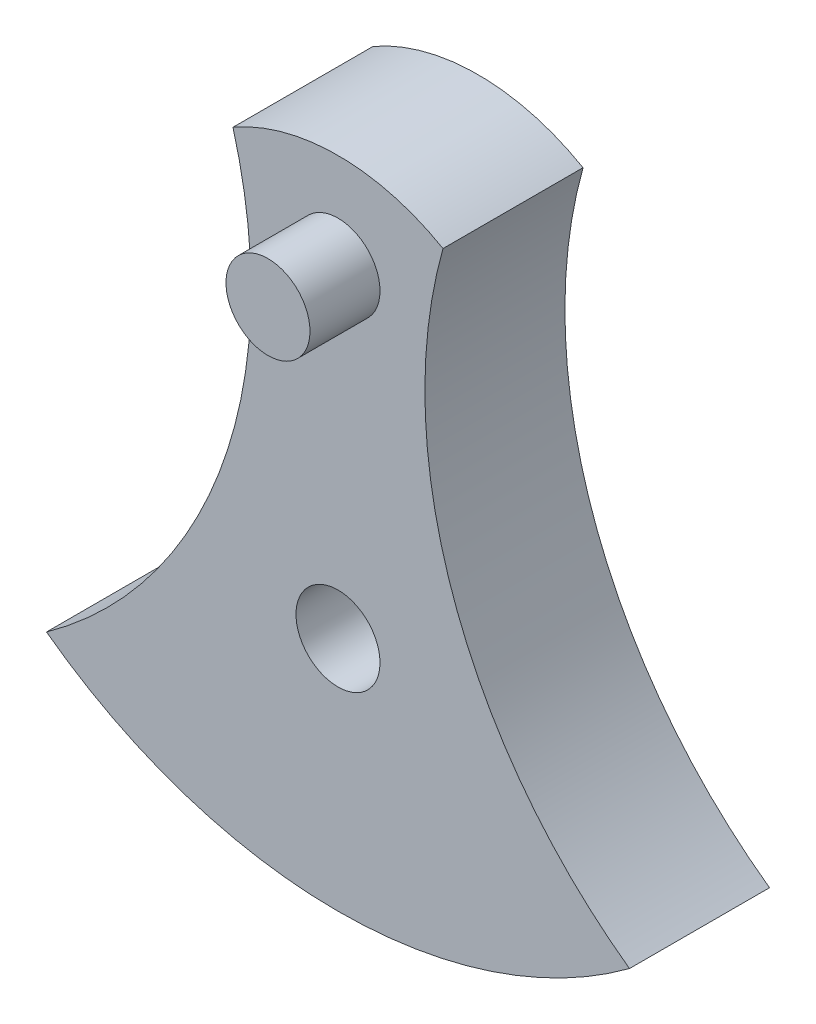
from build123d import *

# Parameters (mm, degrees)
SKETCH1_R           = 3
BOSS_EXTRUDE1_DEPTH = 10
SKETCH1_3_R         = 3
BOSS_EXTRUDE2_DEPTH = 5


with BuildPart() as part:
    # Sketch1 → Boss-Extrude1 (new body)
    with BuildSketch(Plane.XY):
        with BuildLine():
            ThreePointArc((-7.5, 4.869127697), (-8.188126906, -16.169027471), (-20.818797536, -33.007781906))
            ThreePointArc((-20.818797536, -33.007781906), (0, -39.872791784), (20.818797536, -33.007781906))
            ThreePointArc((20.818797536, -33.007781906), (8.188126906, -16.169027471), (7.5, 4.869127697))
            ThreePointArc((7.5, 4.869127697), (0, 6.87874664), (-7.5, 4.869127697))
        make_face()
        with Locations((0, -23)):
            Circle(SKETCH1_R, mode=Mode.SUBTRACT)
        Circle(SKETCH1_R, mode=Mode.SUBTRACT)
    extrude(amount=-BOSS_EXTRUDE1_DEPTH)


with BuildPart() as body_2:
    # Sketch1_3 → Boss-Extrude2 (new body)
    with BuildSketch(Plane.XY):
        Circle(SKETCH1_3_R)
    extrude(amount=BOSS_EXTRUDE2_DEPTH)


solid = Compound([part.part, body_2.part])
